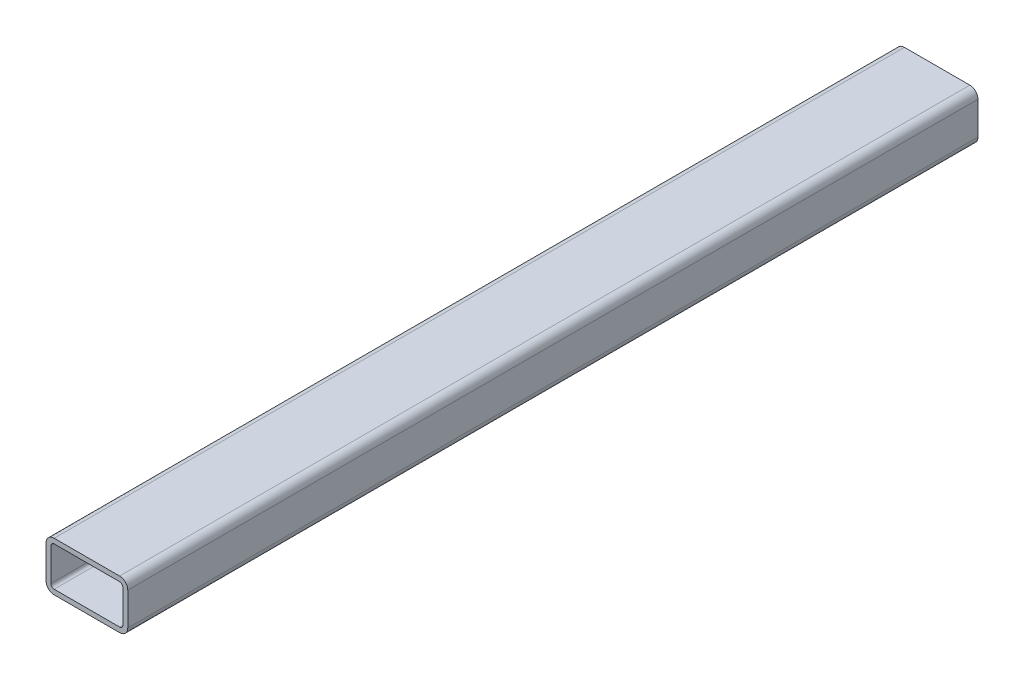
ISO-10303-21;
HEADER;
FILE_DESCRIPTION(('STEP AP214'),'2;1');
FILE_NAME('part.step','',(''),(''),'','','');
FILE_SCHEMA(('AUTOMOTIVE_DESIGN { 1 0 10303 214 1 1 1 1 }'));
ENDSEC;
DATA;
#1=APPLICATION_CONTEXT('core data for automotive mechanical design processes');
#2=APPLICATION_PROTOCOL_DEFINITION('international standard','automotive_design',2000,#1);
#3=PRODUCT_CONTEXT('',#1,'mechanical');
#4=PRODUCT('Part','Part','',(#3));
#5=PRODUCT_RELATED_PRODUCT_CATEGORY('part','',(#4));
#6=PRODUCT_DEFINITION_FORMATION('','',#4);
#7=PRODUCT_DEFINITION_CONTEXT('part definition',#1,'design');
#8=PRODUCT_DEFINITION('design','',#6,#7);
#9=PRODUCT_DEFINITION_SHAPE('','',#8);
#10=(LENGTH_UNIT() NAMED_UNIT(*) SI_UNIT(.MILLI.,.METRE.));
#11=(NAMED_UNIT(*) PLANE_ANGLE_UNIT() SI_UNIT($,.RADIAN.));
#12=(NAMED_UNIT(*) SI_UNIT($,.STERADIAN.) SOLID_ANGLE_UNIT());
#13=UNCERTAINTY_MEASURE_WITH_UNIT(LENGTH_MEASURE(1.E-05),#10,'distance_accuracy_value','');
#14=(GEOMETRIC_REPRESENTATION_CONTEXT(3) GLOBAL_UNCERTAINTY_ASSIGNED_CONTEXT((#13)) GLOBAL_UNIT_ASSIGNED_CONTEXT((#10,
#11,#12)) REPRESENTATION_CONTEXT('',''));
#15=CARTESIAN_POINT('',(0.,0.,0.));
#16=DIRECTION('',(0.,0.,1.));
#17=DIRECTION('',(1.,0.,0.));
#18=AXIS2_PLACEMENT_3D('',#15,#16,#17);
#19=CARTESIAN_POINT('',(-10.,-5.,130.));
#20=DIRECTION('',(0.,0.,1.));
#21=DIRECTION('',(1.,0.,0.));
#22=AXIS2_PLACEMENT_3D('',#19,#20,#21);
#23=PLANE('',#22);
#24=CARTESIAN_POINT('',(-10.,-5.,130.));
#25=DIRECTION('',(0.,0.,1.));
#26=DIRECTION('',(1.,0.,0.));
#27=AXIS2_PLACEMENT_3D('',#24,#25,#26);
#28=CIRCLE('',#27,2.5);
#29=CARTESIAN_POINT('',(-12.5,-5.,130.));
#30=VERTEX_POINT('',#29);
#31=CARTESIAN_POINT('',(-10.,-7.5,130.));
#32=VERTEX_POINT('',#31);
#33=EDGE_CURVE('E210',#30,#32,#28,.T.);
#34=ORIENTED_EDGE('',*,*,#33,.T.);
#35=DIRECTION('',(1.,0.,0.));
#36=VECTOR('',#35,1.);
#37=CARTESIAN_POINT('',(-10.,-7.5,130.));
#38=LINE('',#37,#36);
#39=CARTESIAN_POINT('',(9.99999999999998,-7.5,130.));
#40=VERTEX_POINT('',#39);
#41=EDGE_CURVE('E213',#32,#40,#38,.T.);
#42=ORIENTED_EDGE('',*,*,#41,.T.);
#43=CARTESIAN_POINT('',(9.99999999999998,-5.,130.));
#44=DIRECTION('',(0.,0.,1.));
#45=DIRECTION('',(1.,0.,0.));
#46=AXIS2_PLACEMENT_3D('',#43,#44,#45);
#47=CIRCLE('',#46,2.5);
#48=CARTESIAN_POINT('',(12.5,-5.,130.));
#49=VERTEX_POINT('',#48);
#50=EDGE_CURVE('E216',#40,#49,#47,.T.);
#51=ORIENTED_EDGE('',*,*,#50,.T.);
#52=DIRECTION('',(0.,1.,0.));
#53=VECTOR('',#52,1.);
#54=CARTESIAN_POINT('',(12.5,5.,130.));
#55=LINE('',#54,#53);
#56=CARTESIAN_POINT('',(12.5,5.,130.));
#57=VERTEX_POINT('',#56);
#58=EDGE_CURVE('E218',#49,#57,#55,.T.);
#59=ORIENTED_EDGE('',*,*,#58,.T.);
#60=CARTESIAN_POINT('',(9.99999999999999,5.,130.));
#61=DIRECTION('',(0.,0.,1.));
#62=DIRECTION('',(-1.,0.,0.));
#63=AXIS2_PLACEMENT_3D('',#60,#61,#62);
#64=CIRCLE('',#63,2.5);
#65=CARTESIAN_POINT('',(9.99999999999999,7.5,130.));
#66=VERTEX_POINT('',#65);
#67=EDGE_CURVE('E220',#57,#66,#64,.T.);
#68=ORIENTED_EDGE('',*,*,#67,.T.);
#69=DIRECTION('',(-1.,0.,0.));
#70=VECTOR('',#69,1.);
#71=CARTESIAN_POINT('',(-10.,7.5,130.));
#72=LINE('',#71,#70);
#73=CARTESIAN_POINT('',(-10.,7.5,130.));
#74=VERTEX_POINT('',#73);
#75=EDGE_CURVE('E222',#66,#74,#72,.T.);
#76=ORIENTED_EDGE('',*,*,#75,.T.);
#77=CARTESIAN_POINT('',(-10.,5.,130.));
#78=DIRECTION('',(0.,0.,1.));
#79=DIRECTION('',(1.,0.,0.));
#80=AXIS2_PLACEMENT_3D('',#77,#78,#79);
#81=CIRCLE('',#80,2.5);
#82=CARTESIAN_POINT('',(-12.5,5.,130.));
#83=VERTEX_POINT('',#82);
#84=EDGE_CURVE('E224',#74,#83,#81,.T.);
#85=ORIENTED_EDGE('',*,*,#84,.T.);
#86=DIRECTION('',(0.,-1.,0.));
#87=VECTOR('',#86,1.);
#88=CARTESIAN_POINT('',(-12.5,5.,130.));
#89=LINE('',#88,#87);
#90=EDGE_CURVE('E226',#83,#30,#89,.T.);
#91=ORIENTED_EDGE('',*,*,#90,.T.);
#92=EDGE_LOOP('',(#34,#42,#51,#59,#68,#76,#85,#91));
#93=FACE_BOUND('',#92,.T.);
#94=DIRECTION('',(0.,-1.,0.));
#95=VECTOR('',#94,1.);
#96=CARTESIAN_POINT('',(-11.,5.,130.));
#97=LINE('',#96,#95);
#98=CARTESIAN_POINT('',(-11.,5.,130.));
#99=VERTEX_POINT('',#98);
#100=CARTESIAN_POINT('',(-11.,-5.,130.));
#101=VERTEX_POINT('',#100);
#102=EDGE_CURVE('E153',#99,#101,#97,.T.);
#103=ORIENTED_EDGE('',*,*,#102,.F.);
#104=CARTESIAN_POINT('',(-10.,5.,130.));
#105=DIRECTION('',(0.,0.,1.));
#106=DIRECTION('',(1.,0.,0.));
#107=AXIS2_PLACEMENT_3D('',#104,#105,#106);
#108=CIRCLE('',#107,1.);
#109=CARTESIAN_POINT('',(-10.,6.,130.));
#110=VERTEX_POINT('',#109);
#111=EDGE_CURVE('E145',#110,#99,#108,.T.);
#112=ORIENTED_EDGE('',*,*,#111,.F.);
#113=DIRECTION('',(-1.,0.,0.));
#114=VECTOR('',#113,1.);
#115=CARTESIAN_POINT('',(-10.,6.,130.));
#116=LINE('',#115,#114);
#117=CARTESIAN_POINT('',(9.99999999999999,6.,130.));
#118=VERTEX_POINT('',#117);
#119=EDGE_CURVE('E178',#118,#110,#116,.T.);
#120=ORIENTED_EDGE('',*,*,#119,.F.);
#121=CARTESIAN_POINT('',(9.99999999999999,5.,130.));
#122=DIRECTION('',(0.,0.,1.));
#123=DIRECTION('',(-1.,0.,0.));
#124=AXIS2_PLACEMENT_3D('',#121,#122,#123);
#125=CIRCLE('',#124,1.);
#126=CARTESIAN_POINT('',(11.,5.,130.));
#127=VERTEX_POINT('',#126);
#128=EDGE_CURVE('E176',#127,#118,#125,.T.);
#129=ORIENTED_EDGE('',*,*,#128,.F.);
#130=DIRECTION('',(0.,1.,0.));
#131=VECTOR('',#130,1.);
#132=CARTESIAN_POINT('',(11.,5.,130.));
#133=LINE('',#132,#131);
#134=CARTESIAN_POINT('',(11.,-5.,130.));
#135=VERTEX_POINT('',#134);
#136=EDGE_CURVE('E174',#135,#127,#133,.T.);
#137=ORIENTED_EDGE('',*,*,#136,.F.);
#138=CARTESIAN_POINT('',(9.99999999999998,-5.,130.));
#139=DIRECTION('',(0.,0.,1.));
#140=DIRECTION('',(1.,0.,0.));
#141=AXIS2_PLACEMENT_3D('',#138,#139,#140);
#142=CIRCLE('',#141,1.00000000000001);
#143=CARTESIAN_POINT('',(9.99999999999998,-6.,130.));
#144=VERTEX_POINT('',#143);
#145=EDGE_CURVE('E172',#144,#135,#142,.T.);
#146=ORIENTED_EDGE('',*,*,#145,.F.);
#147=DIRECTION('',(1.,0.,0.));
#148=VECTOR('',#147,1.);
#149=CARTESIAN_POINT('',(-10.,-6.,130.));
#150=LINE('',#149,#148);
#151=CARTESIAN_POINT('',(-10.,-6.,130.));
#152=VERTEX_POINT('',#151);
#153=EDGE_CURVE('E168',#152,#144,#150,.T.);
#154=ORIENTED_EDGE('',*,*,#153,.F.);
#155=CARTESIAN_POINT('',(-10.,-5.,130.));
#156=DIRECTION('',(0.,0.,1.));
#157=DIRECTION('',(1.,0.,0.));
#158=AXIS2_PLACEMENT_3D('',#155,#156,#157);
#159=CIRCLE('',#158,1.);
#160=EDGE_CURVE('E166',#101,#152,#159,.T.);
#161=ORIENTED_EDGE('',*,*,#160,.F.);
#162=EDGE_LOOP('',(#103,#112,#120,#129,#137,#146,#154,#161));
#163=FACE_BOUND('',#162,.T.);
#164=ADVANCED_FACE('F32',(#93,#163),#23,.T.);
#165=CARTESIAN_POINT('',(-10.,-5.,-130.));
#166=DIRECTION('',(0.,0.,1.));
#167=DIRECTION('',(1.,0.,0.));
#168=AXIS2_PLACEMENT_3D('',#165,#166,#167);
#169=PLANE('',#168);
#170=CARTESIAN_POINT('',(-10.,-5.,-130.));
#171=DIRECTION('',(0.,0.,1.));
#172=DIRECTION('',(1.,0.,0.));
#173=AXIS2_PLACEMENT_3D('',#170,#171,#172);
#174=CIRCLE('',#173,2.5);
#175=CARTESIAN_POINT('',(-12.5,-5.,-130.));
#176=VERTEX_POINT('',#175);
#177=CARTESIAN_POINT('',(-10.,-7.5,-130.));
#178=VERTEX_POINT('',#177);
#179=EDGE_CURVE('E161',#176,#178,#174,.T.);
#180=ORIENTED_EDGE('',*,*,#179,.F.);
#181=DIRECTION('',(0.,-1.,0.));
#182=VECTOR('',#181,1.);
#183=CARTESIAN_POINT('',(-12.5,5.,-130.));
#184=LINE('',#183,#182);
#185=CARTESIAN_POINT('',(-12.5,5.,-130.));
#186=VERTEX_POINT('',#185);
#187=EDGE_CURVE('E214',#186,#176,#184,.T.);
#188=ORIENTED_EDGE('',*,*,#187,.F.);
#189=CARTESIAN_POINT('',(-10.,5.,-130.));
#190=DIRECTION('',(0.,0.,1.));
#191=DIRECTION('',(1.,0.,0.));
#192=AXIS2_PLACEMENT_3D('',#189,#190,#191);
#193=CIRCLE('',#192,2.5);
#194=CARTESIAN_POINT('',(-10.,7.5,-130.));
#195=VERTEX_POINT('',#194);
#196=EDGE_CURVE('E241',#195,#186,#193,.T.);
#197=ORIENTED_EDGE('',*,*,#196,.F.);
#198=DIRECTION('',(-1.,0.,0.));
#199=VECTOR('',#198,1.);
#200=CARTESIAN_POINT('',(-10.,7.5,-130.));
#201=LINE('',#200,#199);
#202=CARTESIAN_POINT('',(9.99999999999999,7.5,-130.));
#203=VERTEX_POINT('',#202);
#204=EDGE_CURVE('E239',#203,#195,#201,.T.);
#205=ORIENTED_EDGE('',*,*,#204,.F.);
#206=CARTESIAN_POINT('',(9.99999999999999,5.,-130.));
#207=DIRECTION('',(0.,0.,1.));
#208=DIRECTION('',(-1.,0.,0.));
#209=AXIS2_PLACEMENT_3D('',#206,#207,#208);
#210=CIRCLE('',#209,2.5);
#211=CARTESIAN_POINT('',(12.5,5.,-130.));
#212=VERTEX_POINT('',#211);
#213=EDGE_CURVE('E237',#212,#203,#210,.T.);
#214=ORIENTED_EDGE('',*,*,#213,.F.);
#215=DIRECTION('',(0.,1.,0.));
#216=VECTOR('',#215,1.);
#217=CARTESIAN_POINT('',(12.5,5.,-130.));
#218=LINE('',#217,#216);
#219=CARTESIAN_POINT('',(12.5,-5.,-130.));
#220=VERTEX_POINT('',#219);
#221=EDGE_CURVE('E235',#220,#212,#218,.T.);
#222=ORIENTED_EDGE('',*,*,#221,.F.);
#223=CARTESIAN_POINT('',(9.99999999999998,-5.,-130.));
#224=DIRECTION('',(0.,0.,1.));
#225=DIRECTION('',(1.,0.,0.));
#226=AXIS2_PLACEMENT_3D('',#223,#224,#225);
#227=CIRCLE('',#226,2.5);
#228=CARTESIAN_POINT('',(9.99999999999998,-7.5,-130.));
#229=VERTEX_POINT('',#228);
#230=EDGE_CURVE('E233',#229,#220,#227,.T.);
#231=ORIENTED_EDGE('',*,*,#230,.F.);
#232=DIRECTION('',(1.,0.,0.));
#233=VECTOR('',#232,1.);
#234=CARTESIAN_POINT('',(-10.,-7.5,-130.));
#235=LINE('',#234,#233);
#236=EDGE_CURVE('E231',#178,#229,#235,.T.);
#237=ORIENTED_EDGE('',*,*,#236,.F.);
#238=EDGE_LOOP('',(#180,#188,#197,#205,#214,#222,#231,#237));
#239=FACE_BOUND('',#238,.T.);
#240=CARTESIAN_POINT('',(-10.,5.,-130.));
#241=DIRECTION('',(0.,0.,1.));
#242=DIRECTION('',(1.,0.,0.));
#243=AXIS2_PLACEMENT_3D('',#240,#241,#242);
#244=CIRCLE('',#243,1.);
#245=CARTESIAN_POINT('',(-10.,6.,-130.));
#246=VERTEX_POINT('',#245);
#247=CARTESIAN_POINT('',(-11.,5.,-130.));
#248=VERTEX_POINT('',#247);
#249=EDGE_CURVE('E55',#246,#248,#244,.T.);
#250=ORIENTED_EDGE('',*,*,#249,.T.);
#251=DIRECTION('',(0.,-1.,0.));
#252=VECTOR('',#251,1.);
#253=CARTESIAN_POINT('',(-11.,5.,-130.));
#254=LINE('',#253,#252);
#255=CARTESIAN_POINT('',(-11.,-5.,-130.));
#256=VERTEX_POINT('',#255);
#257=EDGE_CURVE('E160',#248,#256,#254,.T.);
#258=ORIENTED_EDGE('',*,*,#257,.T.);
#259=CARTESIAN_POINT('',(-10.,-5.,-130.));
#260=DIRECTION('',(0.,0.,1.));
#261=DIRECTION('',(1.,0.,0.));
#262=AXIS2_PLACEMENT_3D('',#259,#260,#261);
#263=CIRCLE('',#262,1.);
#264=CARTESIAN_POINT('',(-10.,-6.,-130.));
#265=VERTEX_POINT('',#264);
#266=EDGE_CURVE('E182',#256,#265,#263,.T.);
#267=ORIENTED_EDGE('',*,*,#266,.T.);
#268=DIRECTION('',(1.,0.,0.));
#269=VECTOR('',#268,1.);
#270=CARTESIAN_POINT('',(-10.,-6.,-130.));
#271=LINE('',#270,#269);
#272=CARTESIAN_POINT('',(9.99999999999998,-6.,-130.));
#273=VERTEX_POINT('',#272);
#274=EDGE_CURVE('E185',#265,#273,#271,.T.);
#275=ORIENTED_EDGE('',*,*,#274,.T.);
#276=CARTESIAN_POINT('',(9.99999999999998,-5.,-130.));
#277=DIRECTION('',(0.,0.,1.));
#278=DIRECTION('',(1.,0.,0.));
#279=AXIS2_PLACEMENT_3D('',#276,#277,#278);
#280=CIRCLE('',#279,1.00000000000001);
#281=CARTESIAN_POINT('',(11.,-5.,-130.));
#282=VERTEX_POINT('',#281);
#283=EDGE_CURVE('E188',#273,#282,#280,.T.);
#284=ORIENTED_EDGE('',*,*,#283,.T.);
#285=DIRECTION('',(0.,1.,0.));
#286=VECTOR('',#285,1.);
#287=CARTESIAN_POINT('',(11.,5.,-130.));
#288=LINE('',#287,#286);
#289=CARTESIAN_POINT('',(11.,5.,-130.));
#290=VERTEX_POINT('',#289);
#291=EDGE_CURVE('E191',#282,#290,#288,.T.);
#292=ORIENTED_EDGE('',*,*,#291,.T.);
#293=CARTESIAN_POINT('',(9.99999999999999,5.,-130.));
#294=DIRECTION('',(0.,0.,1.));
#295=DIRECTION('',(-1.,0.,0.));
#296=AXIS2_PLACEMENT_3D('',#293,#294,#295);
#297=CIRCLE('',#296,1.);
#298=CARTESIAN_POINT('',(9.99999999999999,6.,-130.));
#299=VERTEX_POINT('',#298);
#300=EDGE_CURVE('E194',#290,#299,#297,.T.);
#301=ORIENTED_EDGE('',*,*,#300,.T.);
#302=DIRECTION('',(-1.,0.,0.));
#303=VECTOR('',#302,1.);
#304=CARTESIAN_POINT('',(-10.,6.,-130.));
#305=LINE('',#304,#303);
#306=EDGE_CURVE('E154',#299,#246,#305,.T.);
#307=ORIENTED_EDGE('',*,*,#306,.T.);
#308=EDGE_LOOP('',(#250,#258,#267,#275,#284,#292,#301,#307));
#309=FACE_BOUND('',#308,.T.);
#310=ADVANCED_FACE('F271',(#239,#309),#169,.F.);
#311=CARTESIAN_POINT('',(-10.,-5.,130.));
#312=DIRECTION('',(0.,0.,-1.));
#313=DIRECTION('',(-1.,0.,0.));
#314=AXIS2_PLACEMENT_3D('',#311,#312,#313);
#315=CYLINDRICAL_SURFACE('',#314,2.5);
#316=ORIENTED_EDGE('',*,*,#179,.T.);
#317=DIRECTION('',(0.,0.,-1.));
#318=VECTOR('',#317,1.);
#319=CARTESIAN_POINT('',(-10.,-7.5,130.));
#320=LINE('',#319,#318);
#321=EDGE_CURVE('E11',#32,#178,#320,.T.);
#322=ORIENTED_EDGE('',*,*,#321,.F.);
#323=ORIENTED_EDGE('',*,*,#33,.F.);
#324=DIRECTION('',(0.,0.,-1.));
#325=VECTOR('',#324,1.);
#326=CARTESIAN_POINT('',(-12.5,-5.,130.));
#327=LINE('',#326,#325);
#328=EDGE_CURVE('E228',#30,#176,#327,.T.);
#329=ORIENTED_EDGE('',*,*,#328,.T.);
#330=EDGE_LOOP('',(#316,#322,#323,#329));
#331=FACE_BOUND('',#330,.T.);
#332=ADVANCED_FACE('F34',(#331),#315,.T.);
#333=CARTESIAN_POINT('',(-10.,-7.5,130.));
#334=DIRECTION('',(0.,1.,0.));
#335=DIRECTION('',(-1.,0.,0.));
#336=AXIS2_PLACEMENT_3D('',#333,#334,#335);
#337=PLANE('',#336);
#338=ORIENTED_EDGE('',*,*,#236,.T.);
#339=DIRECTION('',(0.,0.,-1.));
#340=VECTOR('',#339,1.);
#341=CARTESIAN_POINT('',(9.99999999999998,-7.5,130.));
#342=LINE('',#341,#340);
#343=EDGE_CURVE('E40',#40,#229,#342,.T.);
#344=ORIENTED_EDGE('',*,*,#343,.F.);
#345=ORIENTED_EDGE('',*,*,#41,.F.);
#346=ORIENTED_EDGE('',*,*,#321,.T.);
#347=EDGE_LOOP('',(#338,#344,#345,#346));
#348=FACE_BOUND('',#347,.T.);
#349=ADVANCED_FACE('F288',(#348),#337,.F.);
#350=CARTESIAN_POINT('',(9.99999999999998,-5.,130.));
#351=DIRECTION('',(0.,0.,-1.));
#352=DIRECTION('',(-1.,0.,0.));
#353=AXIS2_PLACEMENT_3D('',#350,#351,#352);
#354=CYLINDRICAL_SURFACE('',#353,2.5);
#355=ORIENTED_EDGE('',*,*,#230,.T.);
#356=DIRECTION('',(0.,0.,-1.));
#357=VECTOR('',#356,1.);
#358=CARTESIAN_POINT('',(12.5,-5.,130.));
#359=LINE('',#358,#357);
#360=EDGE_CURVE('E258',#49,#220,#359,.T.);
#361=ORIENTED_EDGE('',*,*,#360,.F.);
#362=ORIENTED_EDGE('',*,*,#50,.F.);
#363=ORIENTED_EDGE('',*,*,#343,.T.);
#364=EDGE_LOOP('',(#355,#361,#362,#363));
#365=FACE_BOUND('',#364,.T.);
#366=ADVANCED_FACE('F265',(#365),#354,.T.);
#367=CARTESIAN_POINT('',(12.5,5.,130.));
#368=DIRECTION('',(-1.,0.,0.));
#369=DIRECTION('',(0.,0.,1.));
#370=AXIS2_PLACEMENT_3D('',#367,#368,#369);
#371=PLANE('',#370);
#372=ORIENTED_EDGE('',*,*,#221,.T.);
#373=DIRECTION('',(0.,0.,-1.));
#374=VECTOR('',#373,1.);
#375=CARTESIAN_POINT('',(12.5,5.,130.));
#376=LINE('',#375,#374);
#377=EDGE_CURVE('E255',#57,#212,#376,.T.);
#378=ORIENTED_EDGE('',*,*,#377,.F.);
#379=ORIENTED_EDGE('',*,*,#58,.F.);
#380=ORIENTED_EDGE('',*,*,#360,.T.);
#381=EDGE_LOOP('',(#372,#378,#379,#380));
#382=FACE_BOUND('',#381,.T.);
#383=ADVANCED_FACE('F277',(#382),#371,.F.);
#384=CARTESIAN_POINT('',(9.99999999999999,5.,130.));
#385=DIRECTION('',(0.,0.,-1.));
#386=DIRECTION('',(-1.,0.,0.));
#387=AXIS2_PLACEMENT_3D('',#384,#385,#386);
#388=CYLINDRICAL_SURFACE('',#387,2.5);
#389=ORIENTED_EDGE('',*,*,#213,.T.);
#390=DIRECTION('',(0.,0.,-1.));
#391=VECTOR('',#390,1.);
#392=CARTESIAN_POINT('',(9.99999999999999,7.5,130.));
#393=LINE('',#392,#391);
#394=EDGE_CURVE('E252',#66,#203,#393,.T.);
#395=ORIENTED_EDGE('',*,*,#394,.F.);
#396=ORIENTED_EDGE('',*,*,#67,.F.);
#397=ORIENTED_EDGE('',*,*,#377,.T.);
#398=EDGE_LOOP('',(#389,#395,#396,#397));
#399=FACE_BOUND('',#398,.T.);
#400=ADVANCED_FACE('F281',(#399),#388,.T.);
#401=CARTESIAN_POINT('',(-10.,7.5,130.));
#402=DIRECTION('',(0.,-1.,0.));
#403=DIRECTION('',(1.,0.,0.));
#404=AXIS2_PLACEMENT_3D('',#401,#402,#403);
#405=PLANE('',#404);
#406=ORIENTED_EDGE('',*,*,#204,.T.);
#407=DIRECTION('',(0.,0.,-1.));
#408=VECTOR('',#407,1.);
#409=CARTESIAN_POINT('',(-10.,7.5,130.));
#410=LINE('',#409,#408);
#411=EDGE_CURVE('E249',#74,#195,#410,.T.);
#412=ORIENTED_EDGE('',*,*,#411,.F.);
#413=ORIENTED_EDGE('',*,*,#75,.F.);
#414=ORIENTED_EDGE('',*,*,#394,.T.);
#415=EDGE_LOOP('',(#406,#412,#413,#414));
#416=FACE_BOUND('',#415,.T.);
#417=ADVANCED_FACE('F301',(#416),#405,.F.);
#418=CARTESIAN_POINT('',(-10.,5.,130.));
#419=DIRECTION('',(0.,0.,-1.));
#420=DIRECTION('',(-1.,0.,0.));
#421=AXIS2_PLACEMENT_3D('',#418,#419,#420);
#422=CYLINDRICAL_SURFACE('',#421,2.5);
#423=ORIENTED_EDGE('',*,*,#196,.T.);
#424=DIRECTION('',(0.,0.,-1.));
#425=VECTOR('',#424,1.);
#426=CARTESIAN_POINT('',(-12.5,5.,130.));
#427=LINE('',#426,#425);
#428=EDGE_CURVE('E246',#83,#186,#427,.T.);
#429=ORIENTED_EDGE('',*,*,#428,.F.);
#430=ORIENTED_EDGE('',*,*,#84,.F.);
#431=ORIENTED_EDGE('',*,*,#411,.T.);
#432=EDGE_LOOP('',(#423,#429,#430,#431));
#433=FACE_BOUND('',#432,.T.);
#434=ADVANCED_FACE('F299',(#433),#422,.T.);
#435=CARTESIAN_POINT('',(-12.5,5.,130.));
#436=DIRECTION('',(1.,0.,0.));
#437=DIRECTION('',(0.,0.,-1.));
#438=AXIS2_PLACEMENT_3D('',#435,#436,#437);
#439=PLANE('',#438);
#440=ORIENTED_EDGE('',*,*,#187,.T.);
#441=ORIENTED_EDGE('',*,*,#328,.F.);
#442=ORIENTED_EDGE('',*,*,#90,.F.);
#443=ORIENTED_EDGE('',*,*,#428,.T.);
#444=EDGE_LOOP('',(#440,#441,#442,#443));
#445=FACE_BOUND('',#444,.T.);
#446=ADVANCED_FACE('F294',(#445),#439,.F.);
#447=CARTESIAN_POINT('',(-10.,5.,130.));
#448=DIRECTION('',(0.,0.,-1.));
#449=DIRECTION('',(-1.,0.,0.));
#450=AXIS2_PLACEMENT_3D('',#447,#448,#449);
#451=CYLINDRICAL_SURFACE('',#450,1.);
#452=ORIENTED_EDGE('',*,*,#249,.F.);
#453=DIRECTION('',(0.,0.,-1.));
#454=VECTOR('',#453,1.);
#455=CARTESIAN_POINT('',(-10.,6.,130.));
#456=LINE('',#455,#454);
#457=EDGE_CURVE('E149',#110,#246,#456,.T.);
#458=ORIENTED_EDGE('',*,*,#457,.F.);
#459=ORIENTED_EDGE('',*,*,#111,.T.);
#460=DIRECTION('',(0.,0.,-1.));
#461=VECTOR('',#460,1.);
#462=CARTESIAN_POINT('',(-11.,5.,130.));
#463=LINE('',#462,#461);
#464=EDGE_CURVE('E148',#99,#248,#463,.T.);
#465=ORIENTED_EDGE('',*,*,#464,.T.);
#466=EDGE_LOOP('',(#452,#458,#459,#465));
#467=FACE_BOUND('',#466,.T.);
#468=ADVANCED_FACE('F147',(#467),#451,.F.);
#469=CARTESIAN_POINT('',(-11.,5.,130.));
#470=DIRECTION('',(1.,0.,0.));
#471=DIRECTION('',(0.,1.,0.));
#472=AXIS2_PLACEMENT_3D('',#469,#470,#471);
#473=PLANE('',#472);
#474=ORIENTED_EDGE('',*,*,#257,.F.);
#475=ORIENTED_EDGE('',*,*,#464,.F.);
#476=ORIENTED_EDGE('',*,*,#102,.T.);
#477=DIRECTION('',(0.,0.,-1.));
#478=VECTOR('',#477,1.);
#479=CARTESIAN_POINT('',(-11.,-5.,130.));
#480=LINE('',#479,#478);
#481=EDGE_CURVE('E162',#101,#256,#480,.T.);
#482=ORIENTED_EDGE('',*,*,#481,.T.);
#483=EDGE_LOOP('',(#474,#475,#476,#482));
#484=FACE_BOUND('',#483,.T.);
#485=ADVANCED_FACE('F157',(#484),#473,.T.);
#486=CARTESIAN_POINT('',(-10.,-5.,130.));
#487=DIRECTION('',(0.,0.,-1.));
#488=DIRECTION('',(-1.,0.,0.));
#489=AXIS2_PLACEMENT_3D('',#486,#487,#488);
#490=CYLINDRICAL_SURFACE('',#489,1.);
#491=ORIENTED_EDGE('',*,*,#266,.F.);
#492=ORIENTED_EDGE('',*,*,#481,.F.);
#493=ORIENTED_EDGE('',*,*,#160,.T.);
#494=DIRECTION('',(0.,0.,-1.));
#495=VECTOR('',#494,1.);
#496=CARTESIAN_POINT('',(-10.,-6.,130.));
#497=LINE('',#496,#495);
#498=EDGE_CURVE('E207',#152,#265,#497,.T.);
#499=ORIENTED_EDGE('',*,*,#498,.T.);
#500=EDGE_LOOP('',(#491,#492,#493,#499));
#501=FACE_BOUND('',#500,.T.);
#502=ADVANCED_FACE('F326',(#501),#490,.F.);
#503=CARTESIAN_POINT('',(-10.,-6.,130.));
#504=DIRECTION('',(0.,1.,0.));
#505=DIRECTION('',(-1.,0.,0.));
#506=AXIS2_PLACEMENT_3D('',#503,#504,#505);
#507=PLANE('',#506);
#508=ORIENTED_EDGE('',*,*,#274,.F.);
#509=ORIENTED_EDGE('',*,*,#498,.F.);
#510=ORIENTED_EDGE('',*,*,#153,.T.);
#511=DIRECTION('',(0.,0.,-1.));
#512=VECTOR('',#511,1.);
#513=CARTESIAN_POINT('',(9.99999999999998,-6.,130.));
#514=LINE('',#513,#512);
#515=EDGE_CURVE('E205',#144,#273,#514,.T.);
#516=ORIENTED_EDGE('',*,*,#515,.T.);
#517=EDGE_LOOP('',(#508,#509,#510,#516));
#518=FACE_BOUND('',#517,.T.);
#519=ADVANCED_FACE('F330',(#518),#507,.T.);
#520=CARTESIAN_POINT('',(9.99999999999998,-5.,130.));
#521=DIRECTION('',(0.,0.,-1.));
#522=DIRECTION('',(-1.,0.,0.));
#523=AXIS2_PLACEMENT_3D('',#520,#521,#522);
#524=CYLINDRICAL_SURFACE('',#523,1.00000000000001);
#525=ORIENTED_EDGE('',*,*,#283,.F.);
#526=ORIENTED_EDGE('',*,*,#515,.F.);
#527=ORIENTED_EDGE('',*,*,#145,.T.);
#528=DIRECTION('',(0.,0.,-1.));
#529=VECTOR('',#528,1.);
#530=CARTESIAN_POINT('',(11.,-5.,130.));
#531=LINE('',#530,#529);
#532=EDGE_CURVE('E203',#135,#282,#531,.T.);
#533=ORIENTED_EDGE('',*,*,#532,.T.);
#534=EDGE_LOOP('',(#525,#526,#527,#533));
#535=FACE_BOUND('',#534,.T.);
#536=ADVANCED_FACE('F336',(#535),#524,.F.);
#537=CARTESIAN_POINT('',(11.,5.,130.));
#538=DIRECTION('',(-1.,0.,0.));
#539=DIRECTION('',(0.,-1.,0.));
#540=AXIS2_PLACEMENT_3D('',#537,#538,#539);
#541=PLANE('',#540);
#542=ORIENTED_EDGE('',*,*,#291,.F.);
#543=ORIENTED_EDGE('',*,*,#532,.F.);
#544=ORIENTED_EDGE('',*,*,#136,.T.);
#545=DIRECTION('',(0.,0.,-1.));
#546=VECTOR('',#545,1.);
#547=CARTESIAN_POINT('',(11.,5.,130.));
#548=LINE('',#547,#546);
#549=EDGE_CURVE('E201',#127,#290,#548,.T.);
#550=ORIENTED_EDGE('',*,*,#549,.T.);
#551=EDGE_LOOP('',(#542,#543,#544,#550));
#552=FACE_BOUND('',#551,.T.);
#553=ADVANCED_FACE('F340',(#552),#541,.T.);
#554=CARTESIAN_POINT('',(9.99999999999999,5.,130.));
#555=DIRECTION('',(0.,0.,-1.));
#556=DIRECTION('',(-1.,0.,0.));
#557=AXIS2_PLACEMENT_3D('',#554,#555,#556);
#558=CYLINDRICAL_SURFACE('',#557,1.);
#559=ORIENTED_EDGE('',*,*,#300,.F.);
#560=ORIENTED_EDGE('',*,*,#549,.F.);
#561=ORIENTED_EDGE('',*,*,#128,.T.);
#562=DIRECTION('',(0.,0.,-1.));
#563=VECTOR('',#562,1.);
#564=CARTESIAN_POINT('',(9.99999999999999,6.,130.));
#565=LINE('',#564,#563);
#566=EDGE_CURVE('E47',#118,#299,#565,.T.);
#567=ORIENTED_EDGE('',*,*,#566,.T.);
#568=EDGE_LOOP('',(#559,#560,#561,#567));
#569=FACE_BOUND('',#568,.T.);
#570=ADVANCED_FACE('F344',(#569),#558,.F.);
#571=CARTESIAN_POINT('',(-10.,6.,130.));
#572=DIRECTION('',(0.,-1.,0.));
#573=DIRECTION('',(0.,0.,-1.));
#574=AXIS2_PLACEMENT_3D('',#571,#572,#573);
#575=PLANE('',#574);
#576=ORIENTED_EDGE('',*,*,#306,.F.);
#577=ORIENTED_EDGE('',*,*,#566,.F.);
#578=ORIENTED_EDGE('',*,*,#119,.T.);
#579=ORIENTED_EDGE('',*,*,#457,.T.);
#580=EDGE_LOOP('',(#576,#577,#578,#579));
#581=FACE_BOUND('',#580,.T.);
#582=ADVANCED_FACE('F348',(#581),#575,.T.);
#583=CLOSED_SHELL('',(#164,#310,#332,#349,#366,#383,#400,#417,#434,#446,#468,#485,#502,#519,
#536,#553,#570,#582));
#584=MANIFOLD_SOLID_BREP('B2',#583);
#585=ADVANCED_BREP_SHAPE_REPRESENTATION('',(#18,#584),#14);
#586=SHAPE_DEFINITION_REPRESENTATION(#9,#585);
ENDSEC;
END-ISO-10303-21;
